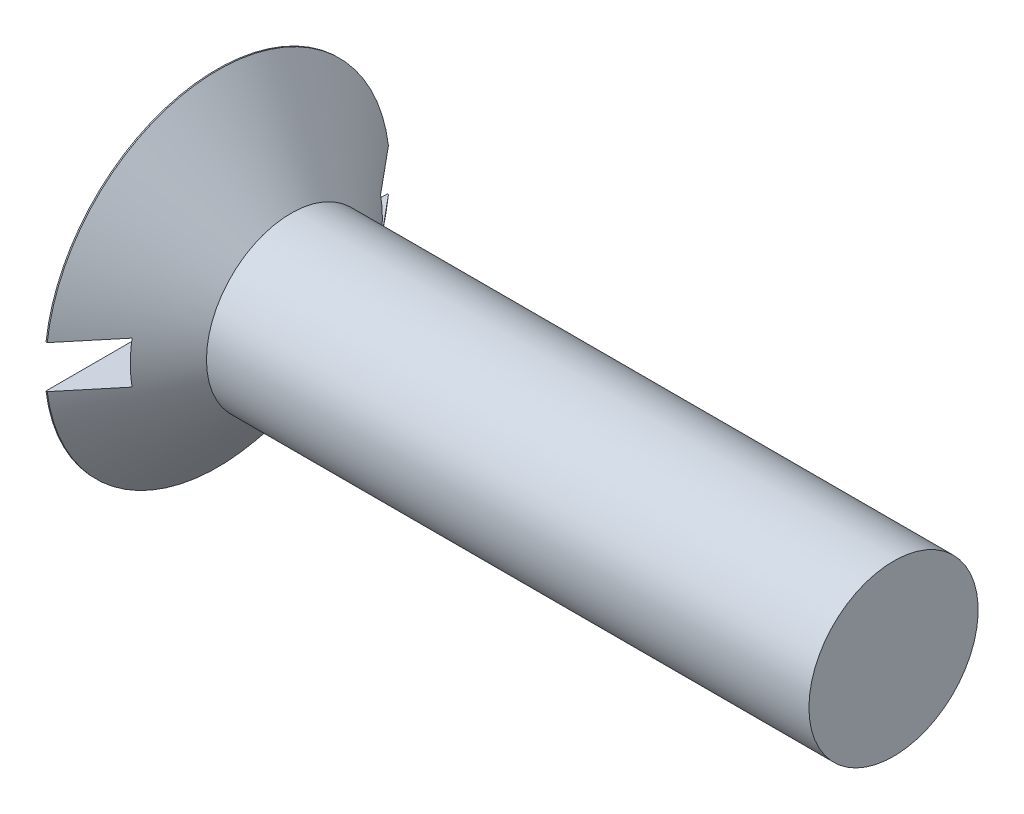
from build123d import *

# Parameters (mm, degrees)
SKETCH2_W         = 19.3548
SKETCH2_H         = 2.3876
SLOT_DEPTH        = 2.2352
CIRPATTERN1_COUNT = 2
CIRPATTERN1_ANGLE = 90


with BuildPart() as part:
    # BodySke → Base-Revolve (revolve)
    with BuildSketch(Plane.XY, mode=Mode.PRIVATE) as base_revolve_sk:
        Polygon((0, 0), (0, 9.6774), (0.066909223, 9.6774), (4.191, 4.7625), (38.1, 4.7625), (38.1, 0), align=None)
    revolve(base_revolve_sk.sketch.rotate(Axis((-6.35, 0, 0), (1, 0, 0)), 90), axis=Axis((-6.35, 0, 0), (1, 0, 0)))

    # Sketch2 → Slot (cut)
    with BuildSketch(Plane.ZY):
        Rectangle(SKETCH2_W, SKETCH2_H)
    extrude(amount=-SLOT_DEPTH, mode=Mode.SUBTRACT)

    # Sketch3 → Cross section 0
    with BuildSketch(Plane.ZY):
        with BuildLine():
            Line((-1.0922, 6.6421), (1.0922, 6.6421))
            Line((1.0922, 6.6421), (1.0922, -6.6421))
            Line((1.0922, -6.6421), (-1.0922, -6.6421))
            Line((-1.0922, -6.6421), (-1.0922, 6.6421))
        make_face()
    # Sketch4 → Cross section 1
    with BuildSketch(Plane.ZY.offset(-7.9756)):
        with BuildLine():
            Line((-0.5461, 0.5461), (0.5461, 0.5461))
            Line((0.5461, 0.5461), (0.5461, -0.5461))
            Line((0.5461, -0.5461), (-0.5461, -0.5461))
            Line((-0.5461, -0.5461), (-0.5461, 0.5461))
        make_face()
    cross = loft(mode=Mode.SUBTRACT)

    # CirPattern1: Cross ×2 about axis
    cirpattern1_axis = Axis((0, 0, 0), (1, 0, 0))
    for i in range(1, CIRPATTERN1_COUNT):
        add(cross.rotate(cirpattern1_axis, i * CIRPATTERN1_ANGLE / (CIRPATTERN1_COUNT - 1)), mode=Mode.SUBTRACT)


solid = part.part
